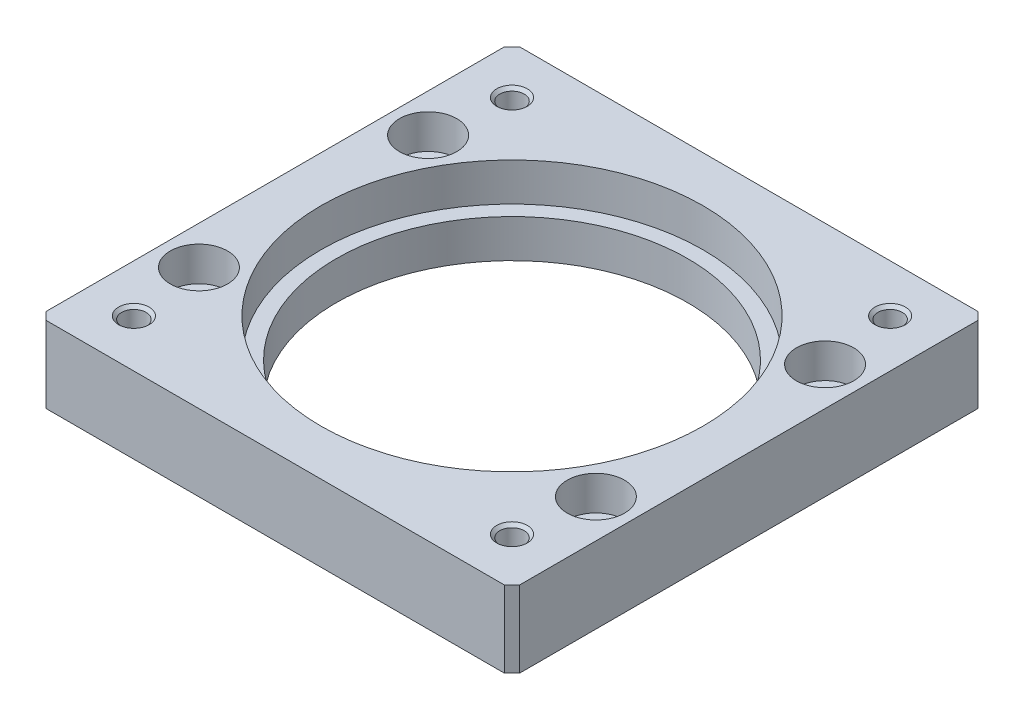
ISO-10303-21;
HEADER;
FILE_DESCRIPTION(('STEP AP214'),'2;1');
FILE_NAME('part.step','',(''),(''),'','','');
FILE_SCHEMA(('AUTOMOTIVE_DESIGN { 1 0 10303 214 1 1 1 1 }'));
ENDSEC;
DATA;
#1=APPLICATION_CONTEXT('core data for automotive mechanical design processes');
#2=APPLICATION_PROTOCOL_DEFINITION('international standard','automotive_design',2000,#1);
#3=PRODUCT_CONTEXT('',#1,'mechanical');
#4=PRODUCT('Part','Part','',(#3));
#5=PRODUCT_RELATED_PRODUCT_CATEGORY('part','',(#4));
#6=PRODUCT_DEFINITION_FORMATION('','',#4);
#7=PRODUCT_DEFINITION_CONTEXT('part definition',#1,'design');
#8=PRODUCT_DEFINITION('design','',#6,#7);
#9=PRODUCT_DEFINITION_SHAPE('','',#8);
#10=(LENGTH_UNIT() NAMED_UNIT(*) SI_UNIT(.MILLI.,.METRE.));
#11=(NAMED_UNIT(*) PLANE_ANGLE_UNIT() SI_UNIT($,.RADIAN.));
#12=(NAMED_UNIT(*) SI_UNIT($,.STERADIAN.) SOLID_ANGLE_UNIT());
#13=UNCERTAINTY_MEASURE_WITH_UNIT(LENGTH_MEASURE(1.E-05),#10,'distance_accuracy_value','');
#14=(GEOMETRIC_REPRESENTATION_CONTEXT(3) GLOBAL_UNCERTAINTY_ASSIGNED_CONTEXT((#13)) GLOBAL_UNIT_ASSIGNED_CONTEXT((#10,
#11,#12)) REPRESENTATION_CONTEXT('',''));
#15=CARTESIAN_POINT('',(0.,0.,0.));
#16=DIRECTION('',(0.,0.,1.));
#17=DIRECTION('',(1.,0.,0.));
#18=AXIS2_PLACEMENT_3D('',#15,#16,#17);
#19=CARTESIAN_POINT('',(-24.74873734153,9.59999999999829,24.74873734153));
#20=DIRECTION('',(0.,1.,0.));
#21=DIRECTION('',(0.,0.,1.));
#22=AXIS2_PLACEMENT_3D('',#19,#20,#21);
#23=CONICAL_SURFACE('',#22,1.60000000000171,0.78539816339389);
#24=CARTESIAN_POINT('',(-24.74873734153,9.6,24.74873734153));
#25=DIRECTION('',(0.,1.,0.));
#26=DIRECTION('',(1.,0.,0.));
#27=AXIS2_PLACEMENT_3D('',#24,#25,#26);
#28=CIRCLE('',#27,1.6);
#29=CARTESIAN_POINT('',(-23.14873734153,9.6,24.74873734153));
#30=VERTEX_POINT('',#29);
#31=EDGE_CURVE('E169',#30,#30,#28,.F.);
#32=ORIENTED_EDGE('',*,*,#31,.T.);
#33=EDGE_LOOP('',(#32));
#34=FACE_BOUND('',#33,.T.);
#35=CARTESIAN_POINT('',(-24.74873734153,9.99999999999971,24.74873734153));
#36=DIRECTION('',(0.,1.,0.));
#37=DIRECTION('',(0.,0.,1.));
#38=AXIS2_PLACEMENT_3D('',#35,#36,#37);
#39=CIRCLE('',#38,2.00000000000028);
#40=CARTESIAN_POINT('',(-24.74873734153,9.99999999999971,26.7487373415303));
#41=VERTEX_POINT('',#40);
#42=EDGE_CURVE('E188',#41,#41,#39,.T.);
#43=ORIENTED_EDGE('',*,*,#42,.T.);
#44=EDGE_LOOP('',(#43));
#45=FACE_BOUND('',#44,.T.);
#46=ADVANCED_FACE('F16',(#34,#45),#23,.F.);
#47=CARTESIAN_POINT('',(24.74873734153,9.59999999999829,24.74873734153));
#48=DIRECTION('',(0.,1.,0.));
#49=DIRECTION('',(0.,0.,1.));
#50=AXIS2_PLACEMENT_3D('',#47,#48,#49);
#51=CONICAL_SURFACE('',#50,1.60000000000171,0.78539816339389);
#52=CARTESIAN_POINT('',(24.74873734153,9.6,24.74873734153));
#53=DIRECTION('',(0.,1.,0.));
#54=DIRECTION('',(1.,0.,0.));
#55=AXIS2_PLACEMENT_3D('',#52,#53,#54);
#56=CIRCLE('',#55,1.6);
#57=CARTESIAN_POINT('',(26.34873734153,9.6,24.74873734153));
#58=VERTEX_POINT('',#57);
#59=EDGE_CURVE('E241',#58,#58,#56,.F.);
#60=ORIENTED_EDGE('',*,*,#59,.T.);
#61=EDGE_LOOP('',(#60));
#62=FACE_BOUND('',#61,.T.);
#63=CARTESIAN_POINT('',(24.74873734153,9.99999999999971,24.74873734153));
#64=DIRECTION('',(0.,1.,0.));
#65=DIRECTION('',(0.,0.,1.));
#66=AXIS2_PLACEMENT_3D('',#63,#64,#65);
#67=CIRCLE('',#66,2.00000000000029);
#68=CARTESIAN_POINT('',(24.74873734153,9.99999999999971,26.7487373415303));
#69=VERTEX_POINT('',#68);
#70=EDGE_CURVE('E185',#69,#69,#67,.T.);
#71=ORIENTED_EDGE('',*,*,#70,.T.);
#72=EDGE_LOOP('',(#71));
#73=FACE_BOUND('',#72,.T.);
#74=ADVANCED_FACE('F342',(#62,#73),#51,.F.);
#75=CARTESIAN_POINT('',(24.74873734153,9.59999999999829,-24.74873734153));
#76=DIRECTION('',(0.,1.,0.));
#77=DIRECTION('',(0.,0.,1.));
#78=AXIS2_PLACEMENT_3D('',#75,#76,#77);
#79=CONICAL_SURFACE('',#78,1.60000000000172,0.785398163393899);
#80=CARTESIAN_POINT('',(24.74873734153,9.6,-24.74873734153));
#81=DIRECTION('',(0.,1.,0.));
#82=DIRECTION('',(1.,0.,0.));
#83=AXIS2_PLACEMENT_3D('',#80,#81,#82);
#84=CIRCLE('',#83,1.6);
#85=CARTESIAN_POINT('',(26.34873734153,9.6,-24.74873734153));
#86=VERTEX_POINT('',#85);
#87=EDGE_CURVE('E238',#86,#86,#84,.F.);
#88=ORIENTED_EDGE('',*,*,#87,.T.);
#89=EDGE_LOOP('',(#88));
#90=FACE_BOUND('',#89,.T.);
#91=CARTESIAN_POINT('',(24.74873734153,9.99999999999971,-24.74873734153));
#92=DIRECTION('',(0.,1.,0.));
#93=DIRECTION('',(0.,0.,1.));
#94=AXIS2_PLACEMENT_3D('',#91,#92,#93);
#95=CIRCLE('',#94,2.00000000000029);
#96=CARTESIAN_POINT('',(24.74873734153,9.99999999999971,-22.7487373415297));
#97=VERTEX_POINT('',#96);
#98=EDGE_CURVE('E191',#97,#97,#95,.T.);
#99=ORIENTED_EDGE('',*,*,#98,.T.);
#100=EDGE_LOOP('',(#99));
#101=FACE_BOUND('',#100,.T.);
#102=ADVANCED_FACE('F346',(#90,#101),#79,.F.);
#103=CARTESIAN_POINT('',(-24.74873734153,9.59999999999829,-24.74873734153));
#104=DIRECTION('',(0.,1.,0.));
#105=DIRECTION('',(-1.,0.,0.));
#106=AXIS2_PLACEMENT_3D('',#103,#104,#105);
#107=CONICAL_SURFACE('',#106,1.60000000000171,0.785398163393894);
#108=CARTESIAN_POINT('',(-24.74873734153,9.6,-24.74873734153));
#109=DIRECTION('',(0.,1.,0.));
#110=DIRECTION('',(1.,0.,0.));
#111=AXIS2_PLACEMENT_3D('',#108,#109,#110);
#112=CIRCLE('',#111,1.6);
#113=CARTESIAN_POINT('',(-23.14873734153,9.6,-24.74873734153));
#114=VERTEX_POINT('',#113);
#115=EDGE_CURVE('E165',#114,#114,#112,.F.);
#116=ORIENTED_EDGE('',*,*,#115,.T.);
#117=EDGE_LOOP('',(#116));
#118=FACE_BOUND('',#117,.T.);
#119=CARTESIAN_POINT('',(-24.74873734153,9.99999999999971,-24.74873734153));
#120=DIRECTION('',(0.,1.,0.));
#121=DIRECTION('',(0.,0.,1.));
#122=AXIS2_PLACEMENT_3D('',#119,#120,#121);
#123=CIRCLE('',#122,2.0000000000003);
#124=CARTESIAN_POINT('',(-24.74873734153,9.99999999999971,-22.7487373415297));
#125=VERTEX_POINT('',#124);
#126=EDGE_CURVE('E166',#125,#125,#123,.T.);
#127=ORIENTED_EDGE('',*,*,#126,.T.);
#128=EDGE_LOOP('',(#127));
#129=FACE_BOUND('',#128,.T.);
#130=ADVANCED_FACE('F350',(#118,#129),#107,.F.);
#131=CARTESIAN_POINT('',(25.98076211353,5.5,-15.));
#132=DIRECTION('',(0.,1.,0.));
#133=DIRECTION('',(0.,0.,1.));
#134=AXIS2_PLACEMENT_3D('',#131,#132,#133);
#135=CYLINDRICAL_SURFACE('',#134,3.75);
#136=CARTESIAN_POINT('',(25.98076211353,5.5,-15.));
#137=DIRECTION('',(0.,1.,0.));
#138=DIRECTION('',(0.,0.,1.));
#139=AXIS2_PLACEMENT_3D('',#136,#137,#138);
#140=CIRCLE('',#139,3.75);
#141=CARTESIAN_POINT('',(25.98076211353,5.5,-11.25));
#142=VERTEX_POINT('',#141);
#143=EDGE_CURVE('E162',#142,#142,#140,.F.);
#144=ORIENTED_EDGE('',*,*,#143,.T.);
#145=EDGE_LOOP('',(#144));
#146=FACE_BOUND('',#145,.T.);
#147=CARTESIAN_POINT('',(25.98076211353,10.,-15.));
#148=DIRECTION('',(0.,1.,0.));
#149=DIRECTION('',(0.,0.,1.));
#150=AXIS2_PLACEMENT_3D('',#147,#148,#149);
#151=CIRCLE('',#150,3.75);
#152=CARTESIAN_POINT('',(25.98076211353,10.,-11.25));
#153=VERTEX_POINT('',#152);
#154=EDGE_CURVE('E179',#153,#153,#151,.T.);
#155=ORIENTED_EDGE('',*,*,#154,.T.);
#156=EDGE_LOOP('',(#155));
#157=FACE_BOUND('',#156,.T.);
#158=ADVANCED_FACE('F354',(#146,#157),#135,.F.);
#159=CARTESIAN_POINT('',(25.98076211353,5.5,15.));
#160=DIRECTION('',(0.,1.,0.));
#161=DIRECTION('',(0.,0.,1.));
#162=AXIS2_PLACEMENT_3D('',#159,#160,#161);
#163=CYLINDRICAL_SURFACE('',#162,3.75);
#164=CARTESIAN_POINT('',(25.98076211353,5.5,15.));
#165=DIRECTION('',(0.,1.,0.));
#166=DIRECTION('',(0.,0.,1.));
#167=AXIS2_PLACEMENT_3D('',#164,#165,#166);
#168=CIRCLE('',#167,3.75);
#169=CARTESIAN_POINT('',(25.98076211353,5.5,18.75));
#170=VERTEX_POINT('',#169);
#171=EDGE_CURVE('E159',#170,#170,#168,.F.);
#172=ORIENTED_EDGE('',*,*,#171,.T.);
#173=EDGE_LOOP('',(#172));
#174=FACE_BOUND('',#173,.T.);
#175=CARTESIAN_POINT('',(25.98076211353,10.,15.));
#176=DIRECTION('',(0.,1.,0.));
#177=DIRECTION('',(0.,0.,1.));
#178=AXIS2_PLACEMENT_3D('',#175,#176,#177);
#179=CIRCLE('',#178,3.75);
#180=CARTESIAN_POINT('',(25.98076211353,10.,18.75));
#181=VERTEX_POINT('',#180);
#182=EDGE_CURVE('E170',#181,#181,#179,.T.);
#183=ORIENTED_EDGE('',*,*,#182,.T.);
#184=EDGE_LOOP('',(#183));
#185=FACE_BOUND('',#184,.T.);
#186=ADVANCED_FACE('F358',(#174,#185),#163,.F.);
#187=CARTESIAN_POINT('',(-25.98076211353,5.5,-15.));
#188=DIRECTION('',(0.,1.,0.));
#189=DIRECTION('',(0.,0.,1.));
#190=AXIS2_PLACEMENT_3D('',#187,#188,#189);
#191=CYLINDRICAL_SURFACE('',#190,3.75);
#192=CARTESIAN_POINT('',(-25.98076211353,5.5,-15.));
#193=DIRECTION('',(0.,1.,0.));
#194=DIRECTION('',(0.,0.,1.));
#195=AXIS2_PLACEMENT_3D('',#192,#193,#194);
#196=CIRCLE('',#195,3.75);
#197=CARTESIAN_POINT('',(-25.98076211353,5.5,-11.25));
#198=VERTEX_POINT('',#197);
#199=EDGE_CURVE('E156',#198,#198,#196,.F.);
#200=ORIENTED_EDGE('',*,*,#199,.T.);
#201=EDGE_LOOP('',(#200));
#202=FACE_BOUND('',#201,.T.);
#203=CARTESIAN_POINT('',(-25.98076211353,10.,-15.));
#204=DIRECTION('',(0.,1.,0.));
#205=DIRECTION('',(0.,0.,1.));
#206=AXIS2_PLACEMENT_3D('',#203,#204,#205);
#207=CIRCLE('',#206,3.75);
#208=CARTESIAN_POINT('',(-25.98076211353,10.,-11.25));
#209=VERTEX_POINT('',#208);
#210=EDGE_CURVE('E176',#209,#209,#207,.T.);
#211=ORIENTED_EDGE('',*,*,#210,.T.);
#212=EDGE_LOOP('',(#211));
#213=FACE_BOUND('',#212,.T.);
#214=ADVANCED_FACE('F362',(#202,#213),#191,.F.);
#215=CARTESIAN_POINT('',(-25.98076211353,5.5,15.));
#216=DIRECTION('',(0.,1.,0.));
#217=DIRECTION('',(0.,0.,1.));
#218=AXIS2_PLACEMENT_3D('',#215,#216,#217);
#219=CYLINDRICAL_SURFACE('',#218,3.75);
#220=CARTESIAN_POINT('',(-25.98076211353,5.5,15.));
#221=DIRECTION('',(0.,1.,0.));
#222=DIRECTION('',(0.,0.,1.));
#223=AXIS2_PLACEMENT_3D('',#220,#221,#222);
#224=CIRCLE('',#223,3.75);
#225=CARTESIAN_POINT('',(-25.98076211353,5.5,18.75));
#226=VERTEX_POINT('',#225);
#227=EDGE_CURVE('E104',#226,#226,#224,.F.);
#228=ORIENTED_EDGE('',*,*,#227,.T.);
#229=EDGE_LOOP('',(#228));
#230=FACE_BOUND('',#229,.T.);
#231=CARTESIAN_POINT('',(-25.98076211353,10.,15.));
#232=DIRECTION('',(0.,1.,0.));
#233=DIRECTION('',(0.,0.,1.));
#234=AXIS2_PLACEMENT_3D('',#231,#232,#233);
#235=CIRCLE('',#234,3.75);
#236=CARTESIAN_POINT('',(-25.98076211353,10.,18.75));
#237=VERTEX_POINT('',#236);
#238=EDGE_CURVE('E173',#237,#237,#235,.T.);
#239=ORIENTED_EDGE('',*,*,#238,.T.);
#240=EDGE_LOOP('',(#239));
#241=FACE_BOUND('',#240,.T.);
#242=ADVANCED_FACE('F366',(#230,#241),#219,.F.);
#243=CARTESIAN_POINT('',(0.,5.,0.));
#244=DIRECTION('',(0.,1.,0.));
#245=DIRECTION('',(0.,0.,1.));
#246=AXIS2_PLACEMENT_3D('',#243,#244,#245);
#247=CYLINDRICAL_SURFACE('',#246,25.);
#248=CARTESIAN_POINT('',(0.,5.,0.));
#249=DIRECTION('',(0.,1.,0.));
#250=DIRECTION('',(0.,0.,1.));
#251=AXIS2_PLACEMENT_3D('',#248,#249,#250);
#252=CIRCLE('',#251,25.);
#253=CARTESIAN_POINT('',(0.,5.,25.));
#254=VERTEX_POINT('',#253);
#255=EDGE_CURVE('E101',#254,#254,#252,.F.);
#256=ORIENTED_EDGE('',*,*,#255,.T.);
#257=EDGE_LOOP('',(#256));
#258=FACE_BOUND('',#257,.T.);
#259=CARTESIAN_POINT('',(0.,10.,0.));
#260=DIRECTION('',(0.,1.,0.));
#261=DIRECTION('',(0.,0.,1.));
#262=AXIS2_PLACEMENT_3D('',#259,#260,#261);
#263=CIRCLE('',#262,25.);
#264=CARTESIAN_POINT('',(0.,10.,25.));
#265=VERTEX_POINT('',#264);
#266=EDGE_CURVE('E182',#265,#265,#263,.T.);
#267=ORIENTED_EDGE('',*,*,#266,.T.);
#268=EDGE_LOOP('',(#267));
#269=FACE_BOUND('',#268,.T.);
#270=ADVANCED_FACE('F339',(#258,#269),#247,.F.);
#271=CARTESIAN_POINT('',(-31.08184,10.2,-29.91816));
#272=DIRECTION('',(-0.707106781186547,0.,-0.707106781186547));
#273=DIRECTION('',(0.707106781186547,0.,-0.707106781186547));
#274=AXIS2_PLACEMENT_3D('',#271,#272,#273);
#275=PLANE('',#274);
#276=DIRECTION('',(0.707106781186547,0.,-0.707106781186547));
#277=VECTOR('',#276,1.);
#278=CARTESIAN_POINT('',(-31.08184,10.,-29.91816));
#279=LINE('',#278,#277);
#280=CARTESIAN_POINT('',(-31.,10.,-30.));
#281=VERTEX_POINT('',#280);
#282=CARTESIAN_POINT('',(-30.,10.,-31.));
#283=VERTEX_POINT('',#282);
#284=EDGE_CURVE('E194',#281,#283,#279,.T.);
#285=ORIENTED_EDGE('',*,*,#284,.T.);
#286=DIRECTION('',(0.,1.,0.));
#287=VECTOR('',#286,1.);
#288=CARTESIAN_POINT('',(-30.,5.,-31.));
#289=LINE('',#288,#287);
#290=CARTESIAN_POINT('',(-30.,0.,-31.));
#291=VERTEX_POINT('',#290);
#292=EDGE_CURVE('E97',#283,#291,#289,.F.);
#293=ORIENTED_EDGE('',*,*,#292,.T.);
#294=DIRECTION('',(-0.707106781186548,0.,0.707106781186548));
#295=VECTOR('',#294,1.);
#296=CARTESIAN_POINT('',(-30.5,0.,-30.5));
#297=LINE('',#296,#295);
#298=CARTESIAN_POINT('',(-31.,0.,-30.));
#299=VERTEX_POINT('',#298);
#300=EDGE_CURVE('E234',#299,#291,#297,.F.);
#301=ORIENTED_EDGE('',*,*,#300,.F.);
#302=DIRECTION('',(0.,-1.,0.));
#303=VECTOR('',#302,1.);
#304=CARTESIAN_POINT('',(-31.,5.,-30.));
#305=LINE('',#304,#303);
#306=EDGE_CURVE('E247',#299,#281,#305,.F.);
#307=ORIENTED_EDGE('',*,*,#306,.T.);
#308=EDGE_LOOP('',(#285,#293,#301,#307));
#309=FACE_BOUND('',#308,.T.);
#310=ADVANCED_FACE('F250',(#309),#275,.T.);
#311=CARTESIAN_POINT('',(-29.91816,10.2,31.08184));
#312=DIRECTION('',(-0.707106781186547,0.,0.707106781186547));
#313=DIRECTION('',(-0.707106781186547,0.,-0.707106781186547));
#314=AXIS2_PLACEMENT_3D('',#311,#312,#313);
#315=PLANE('',#314);
#316=DIRECTION('',(-0.707106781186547,0.,-0.707106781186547));
#317=VECTOR('',#316,1.);
#318=CARTESIAN_POINT('',(-29.91816,10.,31.08184));
#319=LINE('',#318,#317);
#320=CARTESIAN_POINT('',(-30.,10.,31.));
#321=VERTEX_POINT('',#320);
#322=CARTESIAN_POINT('',(-31.,10.,30.));
#323=VERTEX_POINT('',#322);
#324=EDGE_CURVE('E196',#321,#323,#319,.T.);
#325=ORIENTED_EDGE('',*,*,#324,.T.);
#326=DIRECTION('',(0.,1.,0.));
#327=VECTOR('',#326,1.);
#328=CARTESIAN_POINT('',(-31.,5.,30.));
#329=LINE('',#328,#327);
#330=CARTESIAN_POINT('',(-31.,0.,30.));
#331=VERTEX_POINT('',#330);
#332=EDGE_CURVE('E212',#323,#331,#329,.F.);
#333=ORIENTED_EDGE('',*,*,#332,.T.);
#334=DIRECTION('',(0.707106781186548,0.,0.707106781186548));
#335=VECTOR('',#334,1.);
#336=CARTESIAN_POINT('',(-30.5,0.,30.5));
#337=LINE('',#336,#335);
#338=CARTESIAN_POINT('',(-30.,0.,31.));
#339=VERTEX_POINT('',#338);
#340=EDGE_CURVE('E232',#339,#331,#337,.F.);
#341=ORIENTED_EDGE('',*,*,#340,.F.);
#342=DIRECTION('',(0.,-1.,0.));
#343=VECTOR('',#342,1.);
#344=CARTESIAN_POINT('',(-30.,5.,31.));
#345=LINE('',#344,#343);
#346=EDGE_CURVE('E210',#339,#321,#345,.F.);
#347=ORIENTED_EDGE('',*,*,#346,.T.);
#348=EDGE_LOOP('',(#325,#333,#341,#347));
#349=FACE_BOUND('',#348,.T.);
#350=ADVANCED_FACE('F333',(#349),#315,.T.);
#351=CARTESIAN_POINT('',(29.91816,10.2,-31.08184));
#352=DIRECTION('',(0.707106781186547,0.,-0.707106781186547));
#353=DIRECTION('',(0.707106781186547,0.,0.707106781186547));
#354=AXIS2_PLACEMENT_3D('',#351,#352,#353);
#355=PLANE('',#354);
#356=DIRECTION('',(0.707106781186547,0.,0.707106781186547));
#357=VECTOR('',#356,1.);
#358=CARTESIAN_POINT('',(29.91816,10.,-31.08184));
#359=LINE('',#358,#357);
#360=CARTESIAN_POINT('',(30.,10.,-31.));
#361=VERTEX_POINT('',#360);
#362=CARTESIAN_POINT('',(31.,10.,-30.));
#363=VERTEX_POINT('',#362);
#364=EDGE_CURVE('E20',#361,#363,#359,.T.);
#365=ORIENTED_EDGE('',*,*,#364,.T.);
#366=DIRECTION('',(0.,1.,0.));
#367=VECTOR('',#366,1.);
#368=CARTESIAN_POINT('',(31.,5.,-30.));
#369=LINE('',#368,#367);
#370=CARTESIAN_POINT('',(31.,0.,-30.));
#371=VERTEX_POINT('',#370);
#372=EDGE_CURVE('E110',#363,#371,#369,.F.);
#373=ORIENTED_EDGE('',*,*,#372,.T.);
#374=DIRECTION('',(-0.707106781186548,0.,-0.707106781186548));
#375=VECTOR('',#374,1.);
#376=CARTESIAN_POINT('',(30.5,0.,-30.5));
#377=LINE('',#376,#375);
#378=CARTESIAN_POINT('',(30.,0.,-31.));
#379=VERTEX_POINT('',#378);
#380=EDGE_CURVE('E100',#379,#371,#377,.F.);
#381=ORIENTED_EDGE('',*,*,#380,.F.);
#382=DIRECTION('',(0.,-1.,0.));
#383=VECTOR('',#382,1.);
#384=CARTESIAN_POINT('',(30.,5.,-31.));
#385=LINE('',#384,#383);
#386=EDGE_CURVE('E94',#379,#361,#385,.F.);
#387=ORIENTED_EDGE('',*,*,#386,.T.);
#388=EDGE_LOOP('',(#365,#373,#381,#387));
#389=FACE_BOUND('',#388,.T.);
#390=ADVANCED_FACE('F99',(#389),#355,.T.);
#391=CARTESIAN_POINT('',(31.08184,10.2,29.91816));
#392=DIRECTION('',(0.707106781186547,0.,0.707106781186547));
#393=DIRECTION('',(-0.707106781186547,0.,0.707106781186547));
#394=AXIS2_PLACEMENT_3D('',#391,#392,#393);
#395=PLANE('',#394);
#396=DIRECTION('',(-0.707106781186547,0.,0.707106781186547));
#397=VECTOR('',#396,1.);
#398=CARTESIAN_POINT('',(31.08184,10.,29.91816));
#399=LINE('',#398,#397);
#400=CARTESIAN_POINT('',(31.,10.,30.));
#401=VERTEX_POINT('',#400);
#402=CARTESIAN_POINT('',(30.,10.,31.));
#403=VERTEX_POINT('',#402);
#404=EDGE_CURVE('E88',#401,#403,#399,.T.);
#405=ORIENTED_EDGE('',*,*,#404,.T.);
#406=DIRECTION('',(0.,1.,0.));
#407=VECTOR('',#406,1.);
#408=CARTESIAN_POINT('',(30.,5.,31.));
#409=LINE('',#408,#407);
#410=CARTESIAN_POINT('',(30.,0.,31.));
#411=VERTEX_POINT('',#410);
#412=EDGE_CURVE('E108',#403,#411,#409,.F.);
#413=ORIENTED_EDGE('',*,*,#412,.T.);
#414=DIRECTION('',(0.707106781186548,0.,-0.707106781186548));
#415=VECTOR('',#414,1.);
#416=CARTESIAN_POINT('',(30.5,0.,30.5));
#417=LINE('',#416,#415);
#418=CARTESIAN_POINT('',(31.,0.,30.));
#419=VERTEX_POINT('',#418);
#420=EDGE_CURVE('E35',#419,#411,#417,.F.);
#421=ORIENTED_EDGE('',*,*,#420,.F.);
#422=DIRECTION('',(0.,-1.,0.));
#423=VECTOR('',#422,1.);
#424=CARTESIAN_POINT('',(31.,5.,30.));
#425=LINE('',#424,#423);
#426=EDGE_CURVE('E111',#419,#401,#425,.F.);
#427=ORIENTED_EDGE('',*,*,#426,.T.);
#428=EDGE_LOOP('',(#405,#413,#421,#427));
#429=FACE_BOUND('',#428,.T.);
#430=ADVANCED_FACE('F198',(#429),#395,.T.);
#431=CARTESIAN_POINT('',(-32.24,10.,32.24));
#432=DIRECTION('',(0.,1.,0.));
#433=DIRECTION('',(1.,0.,0.));
#434=AXIS2_PLACEMENT_3D('',#431,#432,#433);
#435=PLANE('',#434);
#436=ORIENTED_EDGE('',*,*,#126,.F.);
#437=EDGE_LOOP('',(#436));
#438=FACE_BOUND('',#437,.T.);
#439=ORIENTED_EDGE('',*,*,#182,.F.);
#440=EDGE_LOOP('',(#439));
#441=FACE_BOUND('',#440,.T.);
#442=ORIENTED_EDGE('',*,*,#238,.F.);
#443=EDGE_LOOP('',(#442));
#444=FACE_BOUND('',#443,.T.);
#445=ORIENTED_EDGE('',*,*,#210,.F.);
#446=EDGE_LOOP('',(#445));
#447=FACE_BOUND('',#446,.T.);
#448=ORIENTED_EDGE('',*,*,#154,.F.);
#449=EDGE_LOOP('',(#448));
#450=FACE_BOUND('',#449,.T.);
#451=ORIENTED_EDGE('',*,*,#266,.F.);
#452=EDGE_LOOP('',(#451));
#453=FACE_BOUND('',#452,.T.);
#454=ORIENTED_EDGE('',*,*,#70,.F.);
#455=EDGE_LOOP('',(#454));
#456=FACE_BOUND('',#455,.T.);
#457=ORIENTED_EDGE('',*,*,#42,.F.);
#458=EDGE_LOOP('',(#457));
#459=FACE_BOUND('',#458,.T.);
#460=ORIENTED_EDGE('',*,*,#98,.F.);
#461=EDGE_LOOP('',(#460));
#462=FACE_BOUND('',#461,.T.);
#463=ORIENTED_EDGE('',*,*,#284,.F.);
#464=DIRECTION('',(0.,0.,-1.));
#465=VECTOR('',#464,1.);
#466=CARTESIAN_POINT('',(-31.,10.,0.));
#467=LINE('',#466,#465);
#468=EDGE_CURVE('E218',#281,#323,#467,.F.);
#469=ORIENTED_EDGE('',*,*,#468,.T.);
#470=ORIENTED_EDGE('',*,*,#324,.F.);
#471=DIRECTION('',(-1.,0.,0.));
#472=VECTOR('',#471,1.);
#473=CARTESIAN_POINT('',(0.,10.,31.));
#474=LINE('',#473,#472);
#475=EDGE_CURVE('E205',#321,#403,#474,.F.);
#476=ORIENTED_EDGE('',*,*,#475,.T.);
#477=ORIENTED_EDGE('',*,*,#404,.F.);
#478=DIRECTION('',(0.,0.,1.));
#479=VECTOR('',#478,1.);
#480=CARTESIAN_POINT('',(31.,10.,0.));
#481=LINE('',#480,#479);
#482=EDGE_CURVE('E84',#401,#363,#481,.F.);
#483=ORIENTED_EDGE('',*,*,#482,.T.);
#484=ORIENTED_EDGE('',*,*,#364,.F.);
#485=DIRECTION('',(1.,0.,0.));
#486=VECTOR('',#485,1.);
#487=CARTESIAN_POINT('',(0.,10.,-31.));
#488=LINE('',#487,#486);
#489=EDGE_CURVE('E82',#361,#283,#488,.F.);
#490=ORIENTED_EDGE('',*,*,#489,.T.);
#491=EDGE_LOOP('',(#463,#469,#470,#476,#477,#483,#484,#490));
#492=FACE_BOUND('',#491,.T.);
#493=ADVANCED_FACE('F81',(#438,#441,#444,#447,#450,#453,#456,#459,#462,#492),#435,.T.);
#494=CARTESIAN_POINT('',(-24.74873734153,0.399999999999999,24.74873734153));
#495=DIRECTION('',(0.,1.,0.));
#496=DIRECTION('',(0.,0.,1.));
#497=AXIS2_PLACEMENT_3D('',#494,#495,#496);
#498=CYLINDRICAL_SURFACE('',#497,1.6);
#499=CARTESIAN_POINT('',(-24.74873734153,0.400000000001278,24.74873734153));
#500=DIRECTION('',(0.,-1.,0.));
#501=DIRECTION('',(0.,0.,-1.));
#502=AXIS2_PLACEMENT_3D('',#499,#500,#501);
#503=CIRCLE('',#502,1.60000000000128);
#504=CARTESIAN_POINT('',(-24.74873734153,0.400000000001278,23.1487373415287));
#505=VERTEX_POINT('',#504);
#506=EDGE_CURVE('E219',#505,#505,#503,.T.);
#507=ORIENTED_EDGE('',*,*,#506,.T.);
#508=EDGE_LOOP('',(#507));
#509=FACE_BOUND('',#508,.T.);
#510=ORIENTED_EDGE('',*,*,#31,.F.);
#511=EDGE_LOOP('',(#510));
#512=FACE_BOUND('',#511,.T.);
#513=ADVANCED_FACE('F327',(#509,#512),#498,.F.);
#514=CARTESIAN_POINT('',(24.74873734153,0.399999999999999,24.74873734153));
#515=DIRECTION('',(0.,1.,0.));
#516=DIRECTION('',(0.,0.,1.));
#517=AXIS2_PLACEMENT_3D('',#514,#515,#516);
#518=CYLINDRICAL_SURFACE('',#517,1.6);
#519=CARTESIAN_POINT('',(24.74873734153,0.400000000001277,24.74873734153));
#520=DIRECTION('',(0.,-1.,0.));
#521=DIRECTION('',(0.,0.,-1.));
#522=AXIS2_PLACEMENT_3D('',#519,#520,#521);
#523=CIRCLE('',#522,1.60000000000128);
#524=CARTESIAN_POINT('',(24.74873734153,0.400000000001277,23.1487373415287));
#525=VERTEX_POINT('',#524);
#526=EDGE_CURVE('E221',#525,#525,#523,.T.);
#527=ORIENTED_EDGE('',*,*,#526,.T.);
#528=EDGE_LOOP('',(#527));
#529=FACE_BOUND('',#528,.T.);
#530=ORIENTED_EDGE('',*,*,#59,.F.);
#531=EDGE_LOOP('',(#530));
#532=FACE_BOUND('',#531,.T.);
#533=ADVANCED_FACE('F376',(#529,#532),#518,.F.);
#534=CARTESIAN_POINT('',(24.74873734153,0.399999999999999,-24.74873734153));
#535=DIRECTION('',(0.,1.,0.));
#536=DIRECTION('',(0.,0.,1.));
#537=AXIS2_PLACEMENT_3D('',#534,#535,#536);
#538=CYLINDRICAL_SURFACE('',#537,1.6);
#539=CARTESIAN_POINT('',(24.74873734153,0.400000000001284,-24.74873734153));
#540=DIRECTION('',(0.,-1.,0.));
#541=DIRECTION('',(0.,0.,-1.));
#542=AXIS2_PLACEMENT_3D('',#539,#540,#541);
#543=CIRCLE('',#542,1.60000000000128);
#544=CARTESIAN_POINT('',(24.74873734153,0.400000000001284,-26.3487373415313));
#545=VERTEX_POINT('',#544);
#546=EDGE_CURVE('E226',#545,#545,#543,.T.);
#547=ORIENTED_EDGE('',*,*,#546,.T.);
#548=EDGE_LOOP('',(#547));
#549=FACE_BOUND('',#548,.T.);
#550=ORIENTED_EDGE('',*,*,#87,.F.);
#551=EDGE_LOOP('',(#550));
#552=FACE_BOUND('',#551,.T.);
#553=ADVANCED_FACE('F263',(#549,#552),#538,.F.);
#554=CARTESIAN_POINT('',(-24.74873734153,0.399999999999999,-24.74873734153));
#555=DIRECTION('',(0.,1.,0.));
#556=DIRECTION('',(0.,0.,1.));
#557=AXIS2_PLACEMENT_3D('',#554,#555,#556);
#558=CYLINDRICAL_SURFACE('',#557,1.6);
#559=CARTESIAN_POINT('',(-24.74873734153,0.400000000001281,-24.74873734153));
#560=DIRECTION('',(0.,-1.,0.));
#561=DIRECTION('',(0.,0.,-1.));
#562=AXIS2_PLACEMENT_3D('',#559,#560,#561);
#563=CIRCLE('',#562,1.60000000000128);
#564=CARTESIAN_POINT('',(-24.74873734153,0.400000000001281,-26.3487373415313));
#565=VERTEX_POINT('',#564);
#566=EDGE_CURVE('E152',#565,#565,#563,.T.);
#567=ORIENTED_EDGE('',*,*,#566,.T.);
#568=EDGE_LOOP('',(#567));
#569=FACE_BOUND('',#568,.T.);
#570=ORIENTED_EDGE('',*,*,#115,.F.);
#571=EDGE_LOOP('',(#570));
#572=FACE_BOUND('',#571,.T.);
#573=ADVANCED_FACE('F323',(#569,#572),#558,.F.);
#574=CARTESIAN_POINT('',(-30.91999259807,5.5,19.50812731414));
#575=DIRECTION('',(0.,1.,0.));
#576=DIRECTION('',(1.,0.,0.));
#577=AXIS2_PLACEMENT_3D('',#574,#575,#576);
#578=PLANE('',#577);
#579=CARTESIAN_POINT('',(25.98076211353,5.5,-15.));
#580=DIRECTION('',(0.,1.,0.));
#581=DIRECTION('',(0.,0.,1.));
#582=AXIS2_PLACEMENT_3D('',#579,#580,#581);
#583=CIRCLE('',#582,2.25);
#584=CARTESIAN_POINT('',(25.98076211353,5.5,-12.75));
#585=VERTEX_POINT('',#584);
#586=EDGE_CURVE('E150',#585,#585,#583,.F.);
#587=ORIENTED_EDGE('',*,*,#586,.T.);
#588=EDGE_LOOP('',(#587));
#589=FACE_BOUND('',#588,.T.);
#590=ORIENTED_EDGE('',*,*,#143,.F.);
#591=EDGE_LOOP('',(#590));
#592=FACE_BOUND('',#591,.T.);
#593=ADVANCED_FACE('F319',(#589,#592),#578,.T.);
#594=CARTESIAN_POINT('',(-30.91999259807,5.5,19.50812731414));
#595=DIRECTION('',(0.,1.,0.));
#596=DIRECTION('',(1.,0.,0.));
#597=AXIS2_PLACEMENT_3D('',#594,#595,#596);
#598=PLANE('',#597);
#599=CARTESIAN_POINT('',(25.98076211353,5.5,15.));
#600=DIRECTION('',(0.,1.,0.));
#601=DIRECTION('',(0.,0.,1.));
#602=AXIS2_PLACEMENT_3D('',#599,#600,#601);
#603=CIRCLE('',#602,2.25);
#604=CARTESIAN_POINT('',(25.98076211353,5.5,17.25));
#605=VERTEX_POINT('',#604);
#606=EDGE_CURVE('E147',#605,#605,#603,.F.);
#607=ORIENTED_EDGE('',*,*,#606,.T.);
#608=EDGE_LOOP('',(#607));
#609=FACE_BOUND('',#608,.T.);
#610=ORIENTED_EDGE('',*,*,#171,.F.);
#611=EDGE_LOOP('',(#610));
#612=FACE_BOUND('',#611,.T.);
#613=ADVANCED_FACE('F315',(#609,#612),#598,.T.);
#614=CARTESIAN_POINT('',(-30.91999259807,5.5,19.50812731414));
#615=DIRECTION('',(0.,1.,0.));
#616=DIRECTION('',(1.,0.,0.));
#617=AXIS2_PLACEMENT_3D('',#614,#615,#616);
#618=PLANE('',#617);
#619=CARTESIAN_POINT('',(-25.98076211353,5.5,-15.));
#620=DIRECTION('',(0.,1.,0.));
#621=DIRECTION('',(0.,0.,1.));
#622=AXIS2_PLACEMENT_3D('',#619,#620,#621);
#623=CIRCLE('',#622,2.25);
#624=CARTESIAN_POINT('',(-25.98076211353,5.5,-12.75));
#625=VERTEX_POINT('',#624);
#626=EDGE_CURVE('E144',#625,#625,#623,.F.);
#627=ORIENTED_EDGE('',*,*,#626,.T.);
#628=EDGE_LOOP('',(#627));
#629=FACE_BOUND('',#628,.T.);
#630=ORIENTED_EDGE('',*,*,#199,.F.);
#631=EDGE_LOOP('',(#630));
#632=FACE_BOUND('',#631,.T.);
#633=ADVANCED_FACE('F311',(#629,#632),#618,.T.);
#634=CARTESIAN_POINT('',(-30.91999259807,5.5,19.50812731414));
#635=DIRECTION('',(0.,1.,0.));
#636=DIRECTION('',(1.,0.,0.));
#637=AXIS2_PLACEMENT_3D('',#634,#635,#636);
#638=PLANE('',#637);
#639=CARTESIAN_POINT('',(-25.98076211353,5.5,15.));
#640=DIRECTION('',(0.,1.,0.));
#641=DIRECTION('',(0.,0.,1.));
#642=AXIS2_PLACEMENT_3D('',#639,#640,#641);
#643=CIRCLE('',#642,2.25);
#644=CARTESIAN_POINT('',(-25.98076211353,5.5,17.25));
#645=VERTEX_POINT('',#644);
#646=EDGE_CURVE('E141',#645,#645,#643,.F.);
#647=ORIENTED_EDGE('',*,*,#646,.T.);
#648=EDGE_LOOP('',(#647));
#649=FACE_BOUND('',#648,.T.);
#650=ORIENTED_EDGE('',*,*,#227,.F.);
#651=EDGE_LOOP('',(#650));
#652=FACE_BOUND('',#651,.T.);
#653=ADVANCED_FACE('F307',(#649,#652),#638,.T.);
#654=CARTESIAN_POINT('',(-26.,5.,26.02141434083));
#655=DIRECTION('',(0.,1.,0.));
#656=DIRECTION('',(1.,0.,0.));
#657=AXIS2_PLACEMENT_3D('',#654,#655,#656);
#658=PLANE('',#657);
#659=CARTESIAN_POINT('',(0.,5.,0.));
#660=DIRECTION('',(0.,1.,0.));
#661=DIRECTION('',(0.,0.,1.));
#662=AXIS2_PLACEMENT_3D('',#659,#660,#661);
#663=CIRCLE('',#662,23.);
#664=CARTESIAN_POINT('',(0.,5.,23.));
#665=VERTEX_POINT('',#664);
#666=EDGE_CURVE('E137',#665,#665,#663,.F.);
#667=ORIENTED_EDGE('',*,*,#666,.T.);
#668=EDGE_LOOP('',(#667));
#669=FACE_BOUND('',#668,.T.);
#670=ORIENTED_EDGE('',*,*,#255,.F.);
#671=EDGE_LOOP('',(#670));
#672=FACE_BOUND('',#671,.T.);
#673=ADVANCED_FACE('F304',(#669,#672),#658,.T.);
#674=CARTESIAN_POINT('',(31.2,-0.2,-31.));
#675=DIRECTION('',(0.,0.,-1.));
#676=DIRECTION('',(-1.,0.,0.));
#677=AXIS2_PLACEMENT_3D('',#674,#675,#676);
#678=PLANE('',#677);
#679=ORIENTED_EDGE('',*,*,#292,.F.);
#680=ORIENTED_EDGE('',*,*,#489,.F.);
#681=ORIENTED_EDGE('',*,*,#386,.F.);
#682=DIRECTION('',(-1.,0.,0.));
#683=VECTOR('',#682,1.);
#684=CARTESIAN_POINT('',(0.,0.,-31.));
#685=LINE('',#684,#683);
#686=EDGE_CURVE('E140',#379,#291,#685,.T.);
#687=ORIENTED_EDGE('',*,*,#686,.T.);
#688=EDGE_LOOP('',(#679,#680,#681,#687));
#689=FACE_BOUND('',#688,.T.);
#690=ADVANCED_FACE('F92',(#689),#678,.T.);
#691=CARTESIAN_POINT('',(-31.,-0.2,-31.2));
#692=DIRECTION('',(-1.,0.,0.));
#693=DIRECTION('',(0.,0.,1.));
#694=AXIS2_PLACEMENT_3D('',#691,#692,#693);
#695=PLANE('',#694);
#696=ORIENTED_EDGE('',*,*,#332,.F.);
#697=ORIENTED_EDGE('',*,*,#468,.F.);
#698=ORIENTED_EDGE('',*,*,#306,.F.);
#699=DIRECTION('',(0.,0.,1.));
#700=VECTOR('',#699,1.);
#701=CARTESIAN_POINT('',(-31.,0.,0.));
#702=LINE('',#701,#700);
#703=EDGE_CURVE('E253',#299,#331,#702,.T.);
#704=ORIENTED_EDGE('',*,*,#703,.T.);
#705=EDGE_LOOP('',(#696,#697,#698,#704));
#706=FACE_BOUND('',#705,.T.);
#707=ADVANCED_FACE('F296',(#706),#695,.T.);
#708=CARTESIAN_POINT('',(-31.2,-0.2,31.));
#709=DIRECTION('',(0.,0.,1.));
#710=DIRECTION('',(1.,0.,0.));
#711=AXIS2_PLACEMENT_3D('',#708,#709,#710);
#712=PLANE('',#711);
#713=ORIENTED_EDGE('',*,*,#412,.F.);
#714=ORIENTED_EDGE('',*,*,#475,.F.);
#715=ORIENTED_EDGE('',*,*,#346,.F.);
#716=DIRECTION('',(1.,0.,0.));
#717=VECTOR('',#716,1.);
#718=CARTESIAN_POINT('',(0.,0.,31.));
#719=LINE('',#718,#717);
#720=EDGE_CURVE('E208',#339,#411,#719,.T.);
#721=ORIENTED_EDGE('',*,*,#720,.T.);
#722=EDGE_LOOP('',(#713,#714,#715,#721));
#723=FACE_BOUND('',#722,.T.);
#724=ADVANCED_FACE('F203',(#723),#712,.T.);
#725=CARTESIAN_POINT('',(31.,-0.2,31.2));
#726=DIRECTION('',(1.,0.,0.));
#727=DIRECTION('',(0.,0.,-1.));
#728=AXIS2_PLACEMENT_3D('',#725,#726,#727);
#729=PLANE('',#728);
#730=ORIENTED_EDGE('',*,*,#426,.F.);
#731=DIRECTION('',(0.,0.,-1.));
#732=VECTOR('',#731,1.);
#733=CARTESIAN_POINT('',(31.,0.,0.));
#734=LINE('',#733,#732);
#735=EDGE_CURVE('E136',#419,#371,#734,.T.);
#736=ORIENTED_EDGE('',*,*,#735,.T.);
#737=ORIENTED_EDGE('',*,*,#372,.F.);
#738=ORIENTED_EDGE('',*,*,#482,.F.);
#739=EDGE_LOOP('',(#730,#736,#737,#738));
#740=FACE_BOUND('',#739,.T.);
#741=ADVANCED_FACE('F286',(#740),#729,.T.);
#742=CARTESIAN_POINT('',(-24.74873734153,0.40000000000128,24.74873734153));
#743=DIRECTION('',(0.,-1.,0.));
#744=DIRECTION('',(0.,0.,-1.));
#745=AXIS2_PLACEMENT_3D('',#742,#743,#744);
#746=CONICAL_SURFACE('',#745,1.60000000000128,0.785398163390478);
#747=ORIENTED_EDGE('',*,*,#506,.F.);
#748=EDGE_LOOP('',(#747));
#749=FACE_BOUND('',#748,.T.);
#750=CARTESIAN_POINT('',(-24.74873734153,-1.50926363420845E-12,24.74873734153));
#751=DIRECTION('',(0.,-1.,0.));
#752=DIRECTION('',(0.,0.,-1.));
#753=AXIS2_PLACEMENT_3D('',#750,#751,#752);
#754=CIRCLE('',#753,1.99999999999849);
#755=CARTESIAN_POINT('',(-24.74873734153,-1.50926363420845E-12,22.7487373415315));
#756=VERTEX_POINT('',#755);
#757=EDGE_CURVE('E133',#756,#756,#754,.T.);
#758=ORIENTED_EDGE('',*,*,#757,.T.);
#759=EDGE_LOOP('',(#758));
#760=FACE_BOUND('',#759,.T.);
#761=ADVANCED_FACE('F288',(#749,#760),#746,.F.);
#762=CARTESIAN_POINT('',(24.74873734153,0.40000000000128,24.74873734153));
#763=DIRECTION('',(0.,-1.,0.));
#764=DIRECTION('',(0.,0.,-1.));
#765=AXIS2_PLACEMENT_3D('',#762,#763,#764);
#766=CONICAL_SURFACE('',#765,1.60000000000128,0.785398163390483);
#767=ORIENTED_EDGE('',*,*,#526,.F.);
#768=EDGE_LOOP('',(#767));
#769=FACE_BOUND('',#768,.T.);
#770=CARTESIAN_POINT('',(24.74873734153,-1.50704101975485E-12,24.74873734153));
#771=DIRECTION('',(0.,-1.,0.));
#772=DIRECTION('',(0.,0.,-1.));
#773=AXIS2_PLACEMENT_3D('',#770,#771,#772);
#774=CIRCLE('',#773,1.99999999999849);
#775=CARTESIAN_POINT('',(24.74873734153,-1.50704101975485E-12,22.7487373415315));
#776=VERTEX_POINT('',#775);
#777=EDGE_CURVE('E130',#776,#776,#774,.T.);
#778=ORIENTED_EDGE('',*,*,#777,.T.);
#779=EDGE_LOOP('',(#778));
#780=FACE_BOUND('',#779,.T.);
#781=ADVANCED_FACE('F270',(#769,#780),#766,.F.);
#782=CARTESIAN_POINT('',(24.74873734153,0.400000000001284,-24.74873734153));
#783=DIRECTION('',(0.,-1.,0.));
#784=DIRECTION('',(0.,0.,-1.));
#785=AXIS2_PLACEMENT_3D('',#782,#783,#784);
#786=CONICAL_SURFACE('',#785,1.60000000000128,0.785398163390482);
#787=ORIENTED_EDGE('',*,*,#546,.F.);
#788=EDGE_LOOP('',(#787));
#789=FACE_BOUND('',#788,.T.);
#790=CARTESIAN_POINT('',(24.74873734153,-1.50227053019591E-12,-24.74873734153));
#791=DIRECTION('',(0.,-1.,0.));
#792=DIRECTION('',(0.,0.,-1.));
#793=AXIS2_PLACEMENT_3D('',#790,#791,#792);
#794=CIRCLE('',#793,1.9999999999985);
#795=CARTESIAN_POINT('',(24.74873734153,-1.50227053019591E-12,-26.7487373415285));
#796=VERTEX_POINT('',#795);
#797=EDGE_CURVE('E127',#796,#796,#794,.T.);
#798=ORIENTED_EDGE('',*,*,#797,.T.);
#799=EDGE_LOOP('',(#798));
#800=FACE_BOUND('',#799,.T.);
#801=ADVANCED_FACE('F266',(#789,#800),#786,.F.);
#802=CARTESIAN_POINT('',(-24.74873734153,0.400000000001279,-24.74873734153));
#803=DIRECTION('',(0.,-1.,0.));
#804=DIRECTION('',(1.,0.,0.));
#805=AXIS2_PLACEMENT_3D('',#802,#803,#804);
#806=CONICAL_SURFACE('',#805,1.60000000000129,0.785398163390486);
#807=ORIENTED_EDGE('',*,*,#566,.F.);
#808=EDGE_LOOP('',(#807));
#809=FACE_BOUND('',#808,.T.);
#810=CARTESIAN_POINT('',(-24.74873734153,-1.50053580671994E-12,-24.74873734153));
#811=DIRECTION('',(0.,-1.,0.));
#812=DIRECTION('',(0.,0.,-1.));
#813=AXIS2_PLACEMENT_3D('',#810,#811,#812);
#814=CIRCLE('',#813,1.9999999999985);
#815=CARTESIAN_POINT('',(-24.74873734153,-1.50053580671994E-12,-26.7487373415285));
#816=VERTEX_POINT('',#815);
#817=EDGE_CURVE('E124',#816,#816,#814,.T.);
#818=ORIENTED_EDGE('',*,*,#817,.T.);
#819=EDGE_LOOP('',(#818));
#820=FACE_BOUND('',#819,.T.);
#821=ADVANCED_FACE('F269',(#809,#820),#806,.F.);
#822=CARTESIAN_POINT('',(25.98076211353,0.,-15.));
#823=DIRECTION('',(0.,1.,0.));
#824=DIRECTION('',(0.,0.,1.));
#825=AXIS2_PLACEMENT_3D('',#822,#823,#824);
#826=CYLINDRICAL_SURFACE('',#825,2.25);
#827=CARTESIAN_POINT('',(25.98076211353,0.,-15.));
#828=DIRECTION('',(0.,1.,0.));
#829=DIRECTION('',(0.,0.,1.));
#830=AXIS2_PLACEMENT_3D('',#827,#828,#829);
#831=CIRCLE('',#830,2.25);
#832=CARTESIAN_POINT('',(25.98076211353,0.,-12.75));
#833=VERTEX_POINT('',#832);
#834=EDGE_CURVE('E121',#833,#833,#831,.F.);
#835=ORIENTED_EDGE('',*,*,#834,.T.);
#836=EDGE_LOOP('',(#835));
#837=FACE_BOUND('',#836,.T.);
#838=ORIENTED_EDGE('',*,*,#586,.F.);
#839=EDGE_LOOP('',(#838));
#840=FACE_BOUND('',#839,.T.);
#841=ADVANCED_FACE('F390',(#837,#840),#826,.F.);
#842=CARTESIAN_POINT('',(25.98076211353,0.,15.));
#843=DIRECTION('',(0.,1.,0.));
#844=DIRECTION('',(0.,0.,1.));
#845=AXIS2_PLACEMENT_3D('',#842,#843,#844);
#846=CYLINDRICAL_SURFACE('',#845,2.25);
#847=CARTESIAN_POINT('',(25.98076211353,0.,15.));
#848=DIRECTION('',(0.,1.,0.));
#849=DIRECTION('',(0.,0.,1.));
#850=AXIS2_PLACEMENT_3D('',#847,#848,#849);
#851=CIRCLE('',#850,2.25);
#852=CARTESIAN_POINT('',(25.98076211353,0.,17.25));
#853=VERTEX_POINT('',#852);
#854=EDGE_CURVE('E118',#853,#853,#851,.F.);
#855=ORIENTED_EDGE('',*,*,#854,.T.);
#856=EDGE_LOOP('',(#855));
#857=FACE_BOUND('',#856,.T.);
#858=ORIENTED_EDGE('',*,*,#606,.F.);
#859=EDGE_LOOP('',(#858));
#860=FACE_BOUND('',#859,.T.);
#861=ADVANCED_FACE('F394',(#857,#860),#846,.F.);
#862=CARTESIAN_POINT('',(-25.98076211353,0.,-15.));
#863=DIRECTION('',(0.,1.,0.));
#864=DIRECTION('',(0.,0.,1.));
#865=AXIS2_PLACEMENT_3D('',#862,#863,#864);
#866=CYLINDRICAL_SURFACE('',#865,2.25);
#867=CARTESIAN_POINT('',(-25.98076211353,0.,-15.));
#868=DIRECTION('',(0.,1.,0.));
#869=DIRECTION('',(0.,0.,1.));
#870=AXIS2_PLACEMENT_3D('',#867,#868,#869);
#871=CIRCLE('',#870,2.25);
#872=CARTESIAN_POINT('',(-25.98076211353,0.,-12.75));
#873=VERTEX_POINT('',#872);
#874=EDGE_CURVE('E115',#873,#873,#871,.F.);
#875=ORIENTED_EDGE('',*,*,#874,.T.);
#876=EDGE_LOOP('',(#875));
#877=FACE_BOUND('',#876,.T.);
#878=ORIENTED_EDGE('',*,*,#626,.F.);
#879=EDGE_LOOP('',(#878));
#880=FACE_BOUND('',#879,.T.);
#881=ADVANCED_FACE('F398',(#877,#880),#866,.F.);
#882=CARTESIAN_POINT('',(-25.98076211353,0.,15.));
#883=DIRECTION('',(0.,1.,0.));
#884=DIRECTION('',(0.,0.,1.));
#885=AXIS2_PLACEMENT_3D('',#882,#883,#884);
#886=CYLINDRICAL_SURFACE('',#885,2.25);
#887=CARTESIAN_POINT('',(-25.98076211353,0.,15.));
#888=DIRECTION('',(0.,1.,0.));
#889=DIRECTION('',(0.,0.,1.));
#890=AXIS2_PLACEMENT_3D('',#887,#888,#889);
#891=CIRCLE('',#890,2.25);
#892=CARTESIAN_POINT('',(-25.98076211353,0.,17.25));
#893=VERTEX_POINT('',#892);
#894=EDGE_CURVE('E26',#893,#893,#891,.F.);
#895=ORIENTED_EDGE('',*,*,#894,.T.);
#896=EDGE_LOOP('',(#895));
#897=FACE_BOUND('',#896,.T.);
#898=ORIENTED_EDGE('',*,*,#646,.F.);
#899=EDGE_LOOP('',(#898));
#900=FACE_BOUND('',#899,.T.);
#901=ADVANCED_FACE('F402',(#897,#900),#886,.F.);
#902=CARTESIAN_POINT('',(0.,0.,0.));
#903=DIRECTION('',(0.,1.,0.));
#904=DIRECTION('',(0.,0.,1.));
#905=AXIS2_PLACEMENT_3D('',#902,#903,#904);
#906=CYLINDRICAL_SURFACE('',#905,23.);
#907=CARTESIAN_POINT('',(0.,0.,0.));
#908=DIRECTION('',(0.,1.,0.));
#909=DIRECTION('',(0.,0.,1.));
#910=AXIS2_PLACEMENT_3D('',#907,#908,#909);
#911=CIRCLE('',#910,23.);
#912=CARTESIAN_POINT('',(0.,0.,23.));
#913=VERTEX_POINT('',#912);
#914=EDGE_CURVE('E10',#913,#913,#911,.F.);
#915=ORIENTED_EDGE('',*,*,#914,.T.);
#916=EDGE_LOOP('',(#915));
#917=FACE_BOUND('',#916,.T.);
#918=ORIENTED_EDGE('',*,*,#666,.F.);
#919=EDGE_LOOP('',(#918));
#920=FACE_BOUND('',#919,.T.);
#921=ADVANCED_FACE('F276',(#917,#920),#906,.F.);
#922=CARTESIAN_POINT('',(-32.24,0.,32.24));
#923=DIRECTION('',(0.,1.,0.));
#924=DIRECTION('',(1.,0.,0.));
#925=AXIS2_PLACEMENT_3D('',#922,#923,#924);
#926=PLANE('',#925);
#927=ORIENTED_EDGE('',*,*,#914,.F.);
#928=EDGE_LOOP('',(#927));
#929=FACE_BOUND('',#928,.T.);
#930=ORIENTED_EDGE('',*,*,#894,.F.);
#931=EDGE_LOOP('',(#930));
#932=FACE_BOUND('',#931,.T.);
#933=ORIENTED_EDGE('',*,*,#874,.F.);
#934=EDGE_LOOP('',(#933));
#935=FACE_BOUND('',#934,.T.);
#936=ORIENTED_EDGE('',*,*,#854,.F.);
#937=EDGE_LOOP('',(#936));
#938=FACE_BOUND('',#937,.T.);
#939=ORIENTED_EDGE('',*,*,#834,.F.);
#940=EDGE_LOOP('',(#939));
#941=FACE_BOUND('',#940,.T.);
#942=ORIENTED_EDGE('',*,*,#817,.F.);
#943=EDGE_LOOP('',(#942));
#944=FACE_BOUND('',#943,.T.);
#945=ORIENTED_EDGE('',*,*,#797,.F.);
#946=EDGE_LOOP('',(#945));
#947=FACE_BOUND('',#946,.T.);
#948=ORIENTED_EDGE('',*,*,#777,.F.);
#949=EDGE_LOOP('',(#948));
#950=FACE_BOUND('',#949,.T.);
#951=ORIENTED_EDGE('',*,*,#757,.F.);
#952=EDGE_LOOP('',(#951));
#953=FACE_BOUND('',#952,.T.);
#954=ORIENTED_EDGE('',*,*,#420,.T.);
#955=ORIENTED_EDGE('',*,*,#720,.F.);
#956=ORIENTED_EDGE('',*,*,#340,.T.);
#957=ORIENTED_EDGE('',*,*,#703,.F.);
#958=ORIENTED_EDGE('',*,*,#300,.T.);
#959=ORIENTED_EDGE('',*,*,#686,.F.);
#960=ORIENTED_EDGE('',*,*,#380,.T.);
#961=ORIENTED_EDGE('',*,*,#735,.F.);
#962=EDGE_LOOP('',(#954,#955,#956,#957,#958,#959,#960,#961));
#963=FACE_BOUND('',#962,.T.);
#964=ADVANCED_FACE('F18',(#929,#932,#935,#938,#941,#944,#947,#950,#953,#963),#926,.F.);
#965=CLOSED_SHELL('',(#46,#74,#102,#130,#158,#186,#214,#242,#270,#310,#350,#390,#430,#493,#513,
#533,#553,#573,#593,#613,#633,#653,#673,#690,#707,#724,#741,#761,#781,#801,#821,#841,#861,#881,
#901,#921,#964));
#966=MANIFOLD_SOLID_BREP('B1',#965);
#967=ADVANCED_BREP_SHAPE_REPRESENTATION('',(#18,#966),#14);
#968=SHAPE_DEFINITION_REPRESENTATION(#9,#967);
ENDSEC;
END-ISO-10303-21;
